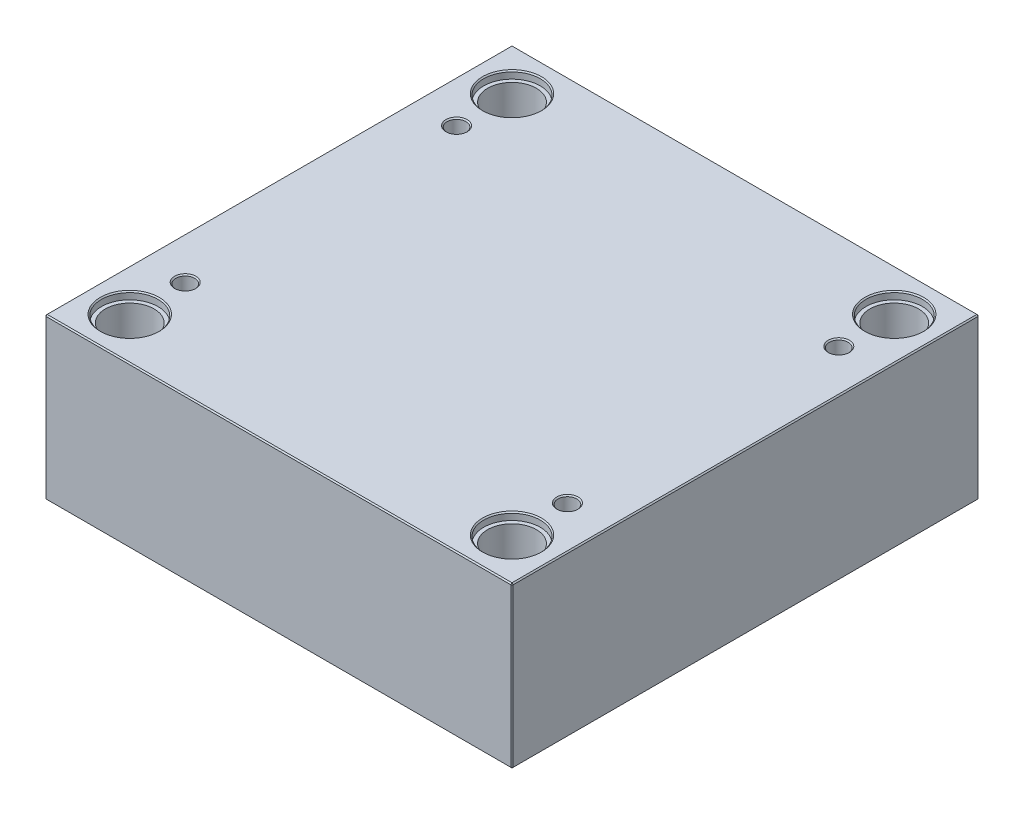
ISO-10303-21;
HEADER;
FILE_DESCRIPTION(('STEP AP214'),'2;1');
FILE_NAME('part.step','',(''),(''),'','','');
FILE_SCHEMA(('AUTOMOTIVE_DESIGN { 1 0 10303 214 1 1 1 1 }'));
ENDSEC;
DATA;
#1=APPLICATION_CONTEXT('core data for automotive mechanical design processes');
#2=APPLICATION_PROTOCOL_DEFINITION('international standard','automotive_design',2000,#1);
#3=PRODUCT_CONTEXT('',#1,'mechanical');
#4=PRODUCT('Part','Part','',(#3));
#5=PRODUCT_RELATED_PRODUCT_CATEGORY('part','',(#4));
#6=PRODUCT_DEFINITION_FORMATION('','',#4);
#7=PRODUCT_DEFINITION_CONTEXT('part definition',#1,'design');
#8=PRODUCT_DEFINITION('design','',#6,#7);
#9=PRODUCT_DEFINITION_SHAPE('','',#8);
#10=(LENGTH_UNIT() NAMED_UNIT(*) SI_UNIT(.MILLI.,.METRE.));
#11=(NAMED_UNIT(*) PLANE_ANGLE_UNIT() SI_UNIT($,.RADIAN.));
#12=(NAMED_UNIT(*) SI_UNIT($,.STERADIAN.) SOLID_ANGLE_UNIT());
#13=UNCERTAINTY_MEASURE_WITH_UNIT(LENGTH_MEASURE(1.E-05),#10,'distance_accuracy_value','');
#14=(GEOMETRIC_REPRESENTATION_CONTEXT(3) GLOBAL_UNCERTAINTY_ASSIGNED_CONTEXT((#13)) GLOBAL_UNIT_ASSIGNED_CONTEXT((#10,
#11,#12)) REPRESENTATION_CONTEXT('',''));
#15=CARTESIAN_POINT('',(0.,0.,0.));
#16=DIRECTION('',(0.,0.,1.));
#17=DIRECTION('',(1.,0.,0.));
#18=AXIS2_PLACEMENT_3D('',#15,#16,#17);
#19=CARTESIAN_POINT('',(-162.,0.,-162.));
#20=DIRECTION('',(0.,1.,0.));
#21=DIRECTION('',(0.,0.,1.));
#22=AXIS2_PLACEMENT_3D('',#19,#20,#21);
#23=CYLINDRICAL_SURFACE('',#22,20.65);
#24=CARTESIAN_POINT('',(-162.,0.999999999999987,-162.));
#25=DIRECTION('',(0.,1.,0.));
#26=DIRECTION('',(0.,0.,1.));
#27=AXIS2_PLACEMENT_3D('',#24,#25,#26);
#28=CIRCLE('',#27,20.65);
#29=CARTESIAN_POINT('',(-162.,0.999999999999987,-141.35));
#30=VERTEX_POINT('',#29);
#31=EDGE_CURVE('E471',#30,#30,#28,.F.);
#32=ORIENTED_EDGE('',*,*,#31,.T.);
#33=EDGE_LOOP('',(#32));
#34=FACE_BOUND('',#33,.T.);
#35=CARTESIAN_POINT('',(-162.,129.7,-162.));
#36=DIRECTION('',(0.,1.,0.));
#37=DIRECTION('',(0.,0.,1.));
#38=AXIS2_PLACEMENT_3D('',#35,#36,#37);
#39=CIRCLE('',#38,20.65);
#40=CARTESIAN_POINT('',(-162.,129.7,-141.35));
#41=VERTEX_POINT('',#40);
#42=EDGE_CURVE('E220',#41,#41,#39,.F.);
#43=ORIENTED_EDGE('',*,*,#42,.F.);
#44=EDGE_LOOP('',(#43));
#45=FACE_BOUND('',#44,.T.);
#46=ADVANCED_FACE('F15',(#34,#45),#23,.F.);
#47=CARTESIAN_POINT('',(162.,0.,-162.));
#48=DIRECTION('',(0.,1.,0.));
#49=DIRECTION('',(0.,0.,1.));
#50=AXIS2_PLACEMENT_3D('',#47,#48,#49);
#51=CYLINDRICAL_SURFACE('',#50,20.65);
#52=CARTESIAN_POINT('',(162.,0.999999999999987,-162.));
#53=DIRECTION('',(0.,1.,0.));
#54=DIRECTION('',(0.,0.,1.));
#55=AXIS2_PLACEMENT_3D('',#52,#53,#54);
#56=CIRCLE('',#55,20.65);
#57=CARTESIAN_POINT('',(162.,0.999999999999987,-141.35));
#58=VERTEX_POINT('',#57);
#59=EDGE_CURVE('E473',#58,#58,#56,.F.);
#60=ORIENTED_EDGE('',*,*,#59,.T.);
#61=EDGE_LOOP('',(#60));
#62=FACE_BOUND('',#61,.T.);
#63=CARTESIAN_POINT('',(162.,129.7,-162.));
#64=DIRECTION('',(0.,1.,0.));
#65=DIRECTION('',(0.,0.,1.));
#66=AXIS2_PLACEMENT_3D('',#63,#64,#65);
#67=CIRCLE('',#66,20.65);
#68=CARTESIAN_POINT('',(162.,129.7,-141.35));
#69=VERTEX_POINT('',#68);
#70=EDGE_CURVE('E217',#69,#69,#67,.F.);
#71=ORIENTED_EDGE('',*,*,#70,.F.);
#72=EDGE_LOOP('',(#71));
#73=FACE_BOUND('',#72,.T.);
#74=ADVANCED_FACE('F262',(#62,#73),#51,.F.);
#75=CARTESIAN_POINT('',(162.,0.,162.));
#76=DIRECTION('',(0.,1.,0.));
#77=DIRECTION('',(0.,0.,1.));
#78=AXIS2_PLACEMENT_3D('',#75,#76,#77);
#79=CYLINDRICAL_SURFACE('',#78,20.65);
#80=CARTESIAN_POINT('',(162.,0.999999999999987,162.));
#81=DIRECTION('',(0.,1.,0.));
#82=DIRECTION('',(0.,0.,1.));
#83=AXIS2_PLACEMENT_3D('',#80,#81,#82);
#84=CIRCLE('',#83,20.65);
#85=CARTESIAN_POINT('',(162.,0.999999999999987,182.65));
#86=VERTEX_POINT('',#85);
#87=EDGE_CURVE('E476',#86,#86,#84,.F.);
#88=ORIENTED_EDGE('',*,*,#87,.T.);
#89=EDGE_LOOP('',(#88));
#90=FACE_BOUND('',#89,.T.);
#91=CARTESIAN_POINT('',(162.,129.7,162.));
#92=DIRECTION('',(0.,1.,0.));
#93=DIRECTION('',(0.,0.,1.));
#94=AXIS2_PLACEMENT_3D('',#91,#92,#93);
#95=CIRCLE('',#94,20.65);
#96=CARTESIAN_POINT('',(162.,129.7,182.65));
#97=VERTEX_POINT('',#96);
#98=EDGE_CURVE('E213',#97,#97,#95,.F.);
#99=ORIENTED_EDGE('',*,*,#98,.F.);
#100=EDGE_LOOP('',(#99));
#101=FACE_BOUND('',#100,.T.);
#102=ADVANCED_FACE('F269',(#90,#101),#79,.F.);
#103=CARTESIAN_POINT('',(-162.,0.,162.));
#104=DIRECTION('',(0.,1.,0.));
#105=DIRECTION('',(0.,0.,1.));
#106=AXIS2_PLACEMENT_3D('',#103,#104,#105);
#107=CYLINDRICAL_SURFACE('',#106,20.65);
#108=CARTESIAN_POINT('',(-162.,0.999999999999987,162.));
#109=DIRECTION('',(0.,1.,0.));
#110=DIRECTION('',(0.,0.,1.));
#111=AXIS2_PLACEMENT_3D('',#108,#109,#110);
#112=CIRCLE('',#111,20.65);
#113=CARTESIAN_POINT('',(-162.,0.999999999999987,182.65));
#114=VERTEX_POINT('',#113);
#115=EDGE_CURVE('E479',#114,#114,#112,.F.);
#116=ORIENTED_EDGE('',*,*,#115,.T.);
#117=EDGE_LOOP('',(#116));
#118=FACE_BOUND('',#117,.T.);
#119=CARTESIAN_POINT('',(-162.,129.7,162.));
#120=DIRECTION('',(0.,1.,0.));
#121=DIRECTION('',(0.,0.,1.));
#122=AXIS2_PLACEMENT_3D('',#119,#120,#121);
#123=CIRCLE('',#122,20.65);
#124=CARTESIAN_POINT('',(-162.,129.7,182.65));
#125=VERTEX_POINT('',#124);
#126=EDGE_CURVE('E210',#125,#125,#123,.F.);
#127=ORIENTED_EDGE('',*,*,#126,.F.);
#128=EDGE_LOOP('',(#127));
#129=FACE_BOUND('',#128,.T.);
#130=ADVANCED_FACE('F276',(#118,#129),#107,.F.);
#131=CARTESIAN_POINT('',(-198.,136.,198.));
#132=DIRECTION('',(1.,0.,0.));
#133=DIRECTION('',(0.,0.,-1.));
#134=AXIS2_PLACEMENT_3D('',#131,#132,#133);
#135=PLANE('',#134);
#136=DIRECTION('',(0.,-1.,0.));
#137=VECTOR('',#136,1.);
#138=CARTESIAN_POINT('',(-198.,136.,-197.));
#139=LINE('',#138,#137);
#140=CARTESIAN_POINT('',(-198.,135.,-197.));
#141=VERTEX_POINT('',#140);
#142=CARTESIAN_POINT('',(-198.,1.,-197.));
#143=VERTEX_POINT('',#142);
#144=EDGE_CURVE('E486',#141,#143,#139,.T.);
#145=ORIENTED_EDGE('',*,*,#144,.T.);
#146=DIRECTION('',(0.,0.,1.));
#147=VECTOR('',#146,1.);
#148=CARTESIAN_POINT('',(-198.,1.,198.));
#149=LINE('',#148,#147);
#150=CARTESIAN_POINT('',(-198.,1.,197.));
#151=VERTEX_POINT('',#150);
#152=EDGE_CURVE('E489',#143,#151,#149,.T.);
#153=ORIENTED_EDGE('',*,*,#152,.T.);
#154=DIRECTION('',(0.,1.,0.));
#155=VECTOR('',#154,1.);
#156=CARTESIAN_POINT('',(-198.,136.,197.));
#157=LINE('',#156,#155);
#158=CARTESIAN_POINT('',(-198.,135.,197.));
#159=VERTEX_POINT('',#158);
#160=EDGE_CURVE('E484',#151,#159,#157,.T.);
#161=ORIENTED_EDGE('',*,*,#160,.T.);
#162=DIRECTION('',(0.,0.,-1.));
#163=VECTOR('',#162,1.);
#164=CARTESIAN_POINT('',(-198.,135.,-198.));
#165=LINE('',#164,#163);
#166=EDGE_CURVE('E482',#159,#141,#165,.T.);
#167=ORIENTED_EDGE('',*,*,#166,.T.);
#168=EDGE_LOOP('',(#145,#153,#161,#167));
#169=FACE_BOUND('',#168,.T.);
#170=ADVANCED_FACE('F297',(#169),#135,.F.);
#171=CARTESIAN_POINT('',(198.,136.,198.));
#172=DIRECTION('',(0.,0.,-1.));
#173=DIRECTION('',(-1.,0.,0.));
#174=AXIS2_PLACEMENT_3D('',#171,#172,#173);
#175=PLANE('',#174);
#176=DIRECTION('',(-1.,0.,0.));
#177=VECTOR('',#176,1.);
#178=CARTESIAN_POINT('',(-198.,135.,198.));
#179=LINE('',#178,#177);
#180=CARTESIAN_POINT('',(197.,135.,198.));
#181=VERTEX_POINT('',#180);
#182=CARTESIAN_POINT('',(-197.,135.,198.));
#183=VERTEX_POINT('',#182);
#184=EDGE_CURVE('E508',#181,#183,#179,.T.);
#185=ORIENTED_EDGE('',*,*,#184,.T.);
#186=DIRECTION('',(0.,-1.,0.));
#187=VECTOR('',#186,1.);
#188=CARTESIAN_POINT('',(-197.,136.,198.));
#189=LINE('',#188,#187);
#190=CARTESIAN_POINT('',(-197.,1.00000000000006,198.));
#191=VERTEX_POINT('',#190);
#192=EDGE_CURVE('E514',#183,#191,#189,.T.);
#193=ORIENTED_EDGE('',*,*,#192,.T.);
#194=DIRECTION('',(1.,0.,0.));
#195=VECTOR('',#194,1.);
#196=CARTESIAN_POINT('',(198.,1.00000000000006,198.));
#197=LINE('',#196,#195);
#198=CARTESIAN_POINT('',(197.,1.00000000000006,198.));
#199=VERTEX_POINT('',#198);
#200=EDGE_CURVE('E512',#191,#199,#197,.T.);
#201=ORIENTED_EDGE('',*,*,#200,.T.);
#202=DIRECTION('',(0.,1.,0.));
#203=VECTOR('',#202,1.);
#204=CARTESIAN_POINT('',(197.,136.,198.));
#205=LINE('',#204,#203);
#206=EDGE_CURVE('E510',#199,#181,#205,.T.);
#207=ORIENTED_EDGE('',*,*,#206,.T.);
#208=EDGE_LOOP('',(#185,#193,#201,#207));
#209=FACE_BOUND('',#208,.T.);
#210=ADVANCED_FACE('F293',(#209),#175,.F.);
#211=CARTESIAN_POINT('',(198.,136.,198.));
#212=DIRECTION('',(-1.,0.,0.));
#213=DIRECTION('',(0.,0.,1.));
#214=AXIS2_PLACEMENT_3D('',#211,#212,#213);
#215=PLANE('',#214);
#216=DIRECTION('',(0.,0.,-1.));
#217=VECTOR('',#216,1.);
#218=CARTESIAN_POINT('',(198.,1.00000000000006,198.));
#219=LINE('',#218,#217);
#220=CARTESIAN_POINT('',(198.,1.00000000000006,197.));
#221=VERTEX_POINT('',#220);
#222=CARTESIAN_POINT('',(198.,1.00000000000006,-197.));
#223=VERTEX_POINT('',#222);
#224=EDGE_CURVE('E503',#221,#223,#219,.T.);
#225=ORIENTED_EDGE('',*,*,#224,.T.);
#226=DIRECTION('',(0.,1.,0.));
#227=VECTOR('',#226,1.);
#228=CARTESIAN_POINT('',(198.,136.,-197.));
#229=LINE('',#228,#227);
#230=CARTESIAN_POINT('',(198.,135.,-197.));
#231=VERTEX_POINT('',#230);
#232=EDGE_CURVE('E505',#223,#231,#229,.T.);
#233=ORIENTED_EDGE('',*,*,#232,.T.);
#234=DIRECTION('',(0.,0.,1.));
#235=VECTOR('',#234,1.);
#236=CARTESIAN_POINT('',(198.,135.,198.));
#237=LINE('',#236,#235);
#238=CARTESIAN_POINT('',(198.,135.,197.));
#239=VERTEX_POINT('',#238);
#240=EDGE_CURVE('E499',#231,#239,#237,.T.);
#241=ORIENTED_EDGE('',*,*,#240,.T.);
#242=DIRECTION('',(0.,-1.,0.));
#243=VECTOR('',#242,1.);
#244=CARTESIAN_POINT('',(198.,136.,197.));
#245=LINE('',#244,#243);
#246=EDGE_CURVE('E501',#239,#221,#245,.T.);
#247=ORIENTED_EDGE('',*,*,#246,.T.);
#248=EDGE_LOOP('',(#225,#233,#241,#247));
#249=FACE_BOUND('',#248,.T.);
#250=ADVANCED_FACE('F289',(#249),#215,.F.);
#251=CARTESIAN_POINT('',(198.,136.,-198.));
#252=DIRECTION('',(0.,0.,1.));
#253=DIRECTION('',(1.,0.,0.));
#254=AXIS2_PLACEMENT_3D('',#251,#252,#253);
#255=PLANE('',#254);
#256=DIRECTION('',(0.,-1.,0.));
#257=VECTOR('',#256,1.);
#258=CARTESIAN_POINT('',(197.,136.,-198.));
#259=LINE('',#258,#257);
#260=CARTESIAN_POINT('',(197.,135.,-198.));
#261=VERTEX_POINT('',#260);
#262=CARTESIAN_POINT('',(197.,1.00000000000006,-198.));
#263=VERTEX_POINT('',#262);
#264=EDGE_CURVE('E493',#261,#263,#259,.T.);
#265=ORIENTED_EDGE('',*,*,#264,.T.);
#266=DIRECTION('',(-1.,0.,0.));
#267=VECTOR('',#266,1.);
#268=CARTESIAN_POINT('',(198.,1.00000000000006,-198.));
#269=LINE('',#268,#267);
#270=CARTESIAN_POINT('',(-197.,1.00000000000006,-198.));
#271=VERTEX_POINT('',#270);
#272=EDGE_CURVE('E137',#263,#271,#269,.T.);
#273=ORIENTED_EDGE('',*,*,#272,.T.);
#274=DIRECTION('',(0.,1.,0.));
#275=VECTOR('',#274,1.);
#276=CARTESIAN_POINT('',(-197.,136.,-198.));
#277=LINE('',#276,#275);
#278=CARTESIAN_POINT('',(-197.,135.,-198.));
#279=VERTEX_POINT('',#278);
#280=EDGE_CURVE('E495',#271,#279,#277,.T.);
#281=ORIENTED_EDGE('',*,*,#280,.T.);
#282=DIRECTION('',(1.,0.,0.));
#283=VECTOR('',#282,1.);
#284=CARTESIAN_POINT('',(198.,135.,-198.));
#285=LINE('',#284,#283);
#286=EDGE_CURVE('E491',#279,#261,#285,.T.);
#287=ORIENTED_EDGE('',*,*,#286,.T.);
#288=EDGE_LOOP('',(#265,#273,#281,#287));
#289=FACE_BOUND('',#288,.T.);
#290=ADVANCED_FACE('F281',(#289),#255,.F.);
#291=CARTESIAN_POINT('',(0.,136.,0.));
#292=DIRECTION('',(0.,1.,0.));
#293=DIRECTION('',(0.,0.,1.));
#294=AXIS2_PLACEMENT_3D('',#291,#292,#293);
#295=PLANE('',#294);
#296=CARTESIAN_POINT('',(162.,136.,162.));
#297=DIRECTION('',(0.,1.,0.));
#298=DIRECTION('',(0.,0.,1.));
#299=AXIS2_PLACEMENT_3D('',#296,#297,#298);
#300=CIRCLE('',#299,25.);
#301=CARTESIAN_POINT('',(162.,136.,187.));
#302=VERTEX_POINT('',#301);
#303=EDGE_CURVE('E235',#302,#302,#300,.F.);
#304=ORIENTED_EDGE('',*,*,#303,.T.);
#305=EDGE_LOOP('',(#304));
#306=FACE_BOUND('',#305,.T.);
#307=CARTESIAN_POINT('',(-162.,136.,162.));
#308=DIRECTION('',(0.,1.,0.));
#309=DIRECTION('',(0.,0.,1.));
#310=AXIS2_PLACEMENT_3D('',#307,#308,#309);
#311=CIRCLE('',#310,25.);
#312=CARTESIAN_POINT('',(-162.,136.,187.));
#313=VERTEX_POINT('',#312);
#314=EDGE_CURVE('E232',#313,#313,#311,.F.);
#315=ORIENTED_EDGE('',*,*,#314,.T.);
#316=EDGE_LOOP('',(#315));
#317=FACE_BOUND('',#316,.T.);
#318=CARTESIAN_POINT('',(162.,136.,-162.));
#319=DIRECTION('',(0.,1.,0.));
#320=DIRECTION('',(0.,0.,1.));
#321=AXIS2_PLACEMENT_3D('',#318,#319,#320);
#322=CIRCLE('',#321,25.);
#323=CARTESIAN_POINT('',(162.,136.,-137.));
#324=VERTEX_POINT('',#323);
#325=EDGE_CURVE('E229',#324,#324,#322,.F.);
#326=ORIENTED_EDGE('',*,*,#325,.T.);
#327=EDGE_LOOP('',(#326));
#328=FACE_BOUND('',#327,.T.);
#329=CARTESIAN_POINT('',(-162.,136.,-162.));
#330=DIRECTION('',(0.,1.,0.));
#331=DIRECTION('',(0.,0.,1.));
#332=AXIS2_PLACEMENT_3D('',#329,#330,#331);
#333=CIRCLE('',#332,25.);
#334=CARTESIAN_POINT('',(-162.,136.,-137.));
#335=VERTEX_POINT('',#334);
#336=EDGE_CURVE('E226',#335,#335,#333,.F.);
#337=ORIENTED_EDGE('',*,*,#336,.T.);
#338=EDGE_LOOP('',(#337));
#339=FACE_BOUND('',#338,.T.);
#340=CARTESIAN_POINT('',(-162.,136.,115.));
#341=DIRECTION('',(0.,1.,0.));
#342=DIRECTION('',(0.,0.,1.));
#343=AXIS2_PLACEMENT_3D('',#340,#341,#342);
#344=CIRCLE('',#343,9.);
#345=CARTESIAN_POINT('',(-162.,136.,124.));
#346=VERTEX_POINT('',#345);
#347=EDGE_CURVE('E197',#346,#346,#344,.F.);
#348=ORIENTED_EDGE('',*,*,#347,.T.);
#349=EDGE_LOOP('',(#348));
#350=FACE_BOUND('',#349,.T.);
#351=CARTESIAN_POINT('',(162.,136.,115.));
#352=DIRECTION('',(0.,1.,0.));
#353=DIRECTION('',(0.,0.,1.));
#354=AXIS2_PLACEMENT_3D('',#351,#352,#353);
#355=CIRCLE('',#354,9.);
#356=CARTESIAN_POINT('',(162.,136.,124.));
#357=VERTEX_POINT('',#356);
#358=EDGE_CURVE('E194',#357,#357,#355,.F.);
#359=ORIENTED_EDGE('',*,*,#358,.T.);
#360=EDGE_LOOP('',(#359));
#361=FACE_BOUND('',#360,.T.);
#362=CARTESIAN_POINT('',(162.,136.,-115.));
#363=DIRECTION('',(0.,1.,0.));
#364=DIRECTION('',(0.,0.,1.));
#365=AXIS2_PLACEMENT_3D('',#362,#363,#364);
#366=CIRCLE('',#365,9.);
#367=CARTESIAN_POINT('',(162.,136.,-106.));
#368=VERTEX_POINT('',#367);
#369=EDGE_CURVE('E191',#368,#368,#366,.F.);
#370=ORIENTED_EDGE('',*,*,#369,.T.);
#371=EDGE_LOOP('',(#370));
#372=FACE_BOUND('',#371,.T.);
#373=CARTESIAN_POINT('',(-162.,136.,-115.));
#374=DIRECTION('',(0.,1.,0.));
#375=DIRECTION('',(0.,0.,1.));
#376=AXIS2_PLACEMENT_3D('',#373,#374,#375);
#377=CIRCLE('',#376,9.);
#378=CARTESIAN_POINT('',(-162.,136.,-106.));
#379=VERTEX_POINT('',#378);
#380=EDGE_CURVE('E187',#379,#379,#377,.F.);
#381=ORIENTED_EDGE('',*,*,#380,.T.);
#382=EDGE_LOOP('',(#381));
#383=FACE_BOUND('',#382,.T.);
#384=DIRECTION('',(0.,0.,-1.));
#385=VECTOR('',#384,1.);
#386=CARTESIAN_POINT('',(197.,136.,-198.));
#387=LINE('',#386,#385);
#388=CARTESIAN_POINT('',(197.,136.,197.));
#389=VERTEX_POINT('',#388);
#390=CARTESIAN_POINT('',(197.,136.,-197.));
#391=VERTEX_POINT('',#390);
#392=EDGE_CURVE('E30',#389,#391,#387,.T.);
#393=ORIENTED_EDGE('',*,*,#392,.T.);
#394=DIRECTION('',(-1.,0.,0.));
#395=VECTOR('',#394,1.);
#396=CARTESIAN_POINT('',(-198.,136.,-197.));
#397=LINE('',#396,#395);
#398=CARTESIAN_POINT('',(-197.,136.,-197.));
#399=VERTEX_POINT('',#398);
#400=EDGE_CURVE('E188',#391,#399,#397,.T.);
#401=ORIENTED_EDGE('',*,*,#400,.T.);
#402=DIRECTION('',(0.,0.,1.));
#403=VECTOR('',#402,1.);
#404=CARTESIAN_POINT('',(-197.,136.,198.));
#405=LINE('',#404,#403);
#406=CARTESIAN_POINT('',(-197.,136.,197.));
#407=VERTEX_POINT('',#406);
#408=EDGE_CURVE('E517',#399,#407,#405,.T.);
#409=ORIENTED_EDGE('',*,*,#408,.T.);
#410=DIRECTION('',(1.,0.,0.));
#411=VECTOR('',#410,1.);
#412=CARTESIAN_POINT('',(198.,136.,197.));
#413=LINE('',#412,#411);
#414=EDGE_CURVE('E35',#407,#389,#413,.T.);
#415=ORIENTED_EDGE('',*,*,#414,.T.);
#416=EDGE_LOOP('',(#393,#401,#409,#415));
#417=FACE_BOUND('',#416,.T.);
#418=ADVANCED_FACE('F278',(#306,#317,#328,#339,#350,#361,#372,#383,#417),#295,.T.);
#419=CARTESIAN_POINT('',(0.,0.,0.));
#420=DIRECTION('',(0.,1.,0.));
#421=DIRECTION('',(0.,0.,1.));
#422=AXIS2_PLACEMENT_3D('',#419,#420,#421);
#423=PLANE('',#422);
#424=CARTESIAN_POINT('',(-162.,0.,-162.));
#425=DIRECTION('',(0.,1.,0.));
#426=DIRECTION('',(0.,0.,1.));
#427=AXIS2_PLACEMENT_3D('',#424,#425,#426);
#428=CIRCLE('',#427,21.65);
#429=CARTESIAN_POINT('',(-162.,0.,-140.35));
#430=VERTEX_POINT('',#429);
#431=EDGE_CURVE('E468',#430,#430,#428,.T.);
#432=ORIENTED_EDGE('',*,*,#431,.T.);
#433=EDGE_LOOP('',(#432));
#434=FACE_BOUND('',#433,.T.);
#435=CARTESIAN_POINT('',(162.,0.,-162.));
#436=DIRECTION('',(0.,1.,0.));
#437=DIRECTION('',(0.,0.,1.));
#438=AXIS2_PLACEMENT_3D('',#435,#436,#437);
#439=CIRCLE('',#438,21.65);
#440=CARTESIAN_POINT('',(162.,0.,-140.35));
#441=VERTEX_POINT('',#440);
#442=EDGE_CURVE('E465',#441,#441,#439,.T.);
#443=ORIENTED_EDGE('',*,*,#442,.T.);
#444=EDGE_LOOP('',(#443));
#445=FACE_BOUND('',#444,.T.);
#446=CARTESIAN_POINT('',(162.,0.,162.));
#447=DIRECTION('',(0.,1.,0.));
#448=DIRECTION('',(0.,0.,1.));
#449=AXIS2_PLACEMENT_3D('',#446,#447,#448);
#450=CIRCLE('',#449,21.65);
#451=CARTESIAN_POINT('',(162.,0.,183.65));
#452=VERTEX_POINT('',#451);
#453=EDGE_CURVE('E462',#452,#452,#450,.T.);
#454=ORIENTED_EDGE('',*,*,#453,.T.);
#455=EDGE_LOOP('',(#454));
#456=FACE_BOUND('',#455,.T.);
#457=CARTESIAN_POINT('',(-162.,0.,162.));
#458=DIRECTION('',(0.,1.,0.));
#459=DIRECTION('',(0.,0.,1.));
#460=AXIS2_PLACEMENT_3D('',#457,#458,#459);
#461=CIRCLE('',#460,21.65);
#462=CARTESIAN_POINT('',(-162.,0.,183.65));
#463=VERTEX_POINT('',#462);
#464=EDGE_CURVE('E459',#463,#463,#461,.T.);
#465=ORIENTED_EDGE('',*,*,#464,.T.);
#466=EDGE_LOOP('',(#465));
#467=FACE_BOUND('',#466,.T.);
#468=DIRECTION('',(0.,0.,1.));
#469=VECTOR('',#468,1.);
#470=CARTESIAN_POINT('',(197.,0.,0.));
#471=LINE('',#470,#469);
#472=CARTESIAN_POINT('',(197.,0.,-197.));
#473=VERTEX_POINT('',#472);
#474=CARTESIAN_POINT('',(197.,0.,197.));
#475=VERTEX_POINT('',#474);
#476=EDGE_CURVE('E107',#473,#475,#471,.T.);
#477=ORIENTED_EDGE('',*,*,#476,.T.);
#478=DIRECTION('',(-1.,0.,0.));
#479=VECTOR('',#478,1.);
#480=CARTESIAN_POINT('',(0.,0.,197.));
#481=LINE('',#480,#479);
#482=CARTESIAN_POINT('',(-197.,0.,197.));
#483=VERTEX_POINT('',#482);
#484=EDGE_CURVE('E457',#475,#483,#481,.T.);
#485=ORIENTED_EDGE('',*,*,#484,.T.);
#486=DIRECTION('',(0.,0.,-1.));
#487=VECTOR('',#486,1.);
#488=CARTESIAN_POINT('',(-197.,0.,0.));
#489=LINE('',#488,#487);
#490=CARTESIAN_POINT('',(-197.,0.,-197.));
#491=VERTEX_POINT('',#490);
#492=EDGE_CURVE('E109',#483,#491,#489,.T.);
#493=ORIENTED_EDGE('',*,*,#492,.T.);
#494=DIRECTION('',(1.,0.,0.));
#495=VECTOR('',#494,1.);
#496=CARTESIAN_POINT('',(0.,0.,-197.));
#497=LINE('',#496,#495);
#498=EDGE_CURVE('E103',#491,#473,#497,.T.);
#499=ORIENTED_EDGE('',*,*,#498,.T.);
#500=EDGE_LOOP('',(#477,#485,#493,#499));
#501=FACE_BOUND('',#500,.T.);
#502=ADVANCED_FACE('F105',(#434,#445,#456,#467,#501),#423,.F.);
#503=CARTESIAN_POINT('',(-162.,0.,-162.));
#504=DIRECTION('',(0.,-1.,0.));
#505=DIRECTION('',(0.,0.,-1.));
#506=AXIS2_PLACEMENT_3D('',#503,#504,#505);
#507=CONICAL_SURFACE('',#506,21.65,0.785398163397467);
#508=ORIENTED_EDGE('',*,*,#31,.F.);
#509=EDGE_LOOP('',(#508));
#510=FACE_BOUND('',#509,.T.);
#511=ORIENTED_EDGE('',*,*,#431,.F.);
#512=EDGE_LOOP('',(#511));
#513=FACE_BOUND('',#512,.T.);
#514=ADVANCED_FACE('F285',(#510,#513),#507,.F.);
#515=CARTESIAN_POINT('',(162.,0.,-162.));
#516=DIRECTION('',(0.,-1.,0.));
#517=DIRECTION('',(0.,0.,-1.));
#518=AXIS2_PLACEMENT_3D('',#515,#516,#517);
#519=CONICAL_SURFACE('',#518,21.65,0.785398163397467);
#520=ORIENTED_EDGE('',*,*,#59,.F.);
#521=EDGE_LOOP('',(#520));
#522=FACE_BOUND('',#521,.T.);
#523=ORIENTED_EDGE('',*,*,#442,.F.);
#524=EDGE_LOOP('',(#523));
#525=FACE_BOUND('',#524,.T.);
#526=ADVANCED_FACE('F304',(#522,#525),#519,.F.);
#527=CARTESIAN_POINT('',(162.,0.,162.));
#528=DIRECTION('',(0.,-1.,0.));
#529=DIRECTION('',(0.,0.,-1.));
#530=AXIS2_PLACEMENT_3D('',#527,#528,#529);
#531=CONICAL_SURFACE('',#530,21.65,0.785398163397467);
#532=ORIENTED_EDGE('',*,*,#87,.F.);
#533=EDGE_LOOP('',(#532));
#534=FACE_BOUND('',#533,.T.);
#535=ORIENTED_EDGE('',*,*,#453,.F.);
#536=EDGE_LOOP('',(#535));
#537=FACE_BOUND('',#536,.T.);
#538=ADVANCED_FACE('F308',(#534,#537),#531,.F.);
#539=CARTESIAN_POINT('',(-162.,0.,162.));
#540=DIRECTION('',(0.,-1.,0.));
#541=DIRECTION('',(0.,0.,-1.));
#542=AXIS2_PLACEMENT_3D('',#539,#540,#541);
#543=CONICAL_SURFACE('',#542,21.65,0.785398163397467);
#544=ORIENTED_EDGE('',*,*,#115,.F.);
#545=EDGE_LOOP('',(#544));
#546=FACE_BOUND('',#545,.T.);
#547=ORIENTED_EDGE('',*,*,#464,.F.);
#548=EDGE_LOOP('',(#547));
#549=FACE_BOUND('',#548,.T.);
#550=ADVANCED_FACE('F312',(#546,#549),#543,.F.);
#551=CARTESIAN_POINT('',(198.,136.,197.));
#552=DIRECTION('',(-0.707106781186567,0.,-0.707106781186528));
#553=DIRECTION('',(0.,-1.,0.));
#554=AXIS2_PLACEMENT_3D('',#551,#552,#553);
#555=PLANE('',#554);
#556=DIRECTION('',(-0.707106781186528,0.,0.707106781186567));
#557=VECTOR('',#556,1.);
#558=CARTESIAN_POINT('',(197.,135.,198.));
#559=LINE('',#558,#557);
#560=EDGE_CURVE('E125',#181,#239,#559,.F.);
#561=ORIENTED_EDGE('',*,*,#560,.F.);
#562=ORIENTED_EDGE('',*,*,#206,.F.);
#563=DIRECTION('',(0.707106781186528,0.,-0.707106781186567));
#564=VECTOR('',#563,1.);
#565=CARTESIAN_POINT('',(197.,1.00000000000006,198.));
#566=LINE('',#565,#564);
#567=EDGE_CURVE('E179',#221,#199,#566,.F.);
#568=ORIENTED_EDGE('',*,*,#567,.F.);
#569=ORIENTED_EDGE('',*,*,#246,.F.);
#570=EDGE_LOOP('',(#561,#562,#568,#569));
#571=FACE_BOUND('',#570,.T.);
#572=ADVANCED_FACE('F316',(#571),#555,.F.);
#573=CARTESIAN_POINT('',(197.,135.,198.));
#574=DIRECTION('',(0.577350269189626,0.577350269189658,0.577350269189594));
#575=DIRECTION('',(-0.707106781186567,0.707106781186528,0.));
#576=AXIS2_PLACEMENT_3D('',#573,#574,#575);
#577=PLANE('',#576);
#578=DIRECTION('',(0.,-0.707106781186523,0.707106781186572));
#579=VECTOR('',#578,1.);
#580=CARTESIAN_POINT('',(197.,135.,198.));
#581=LINE('',#580,#579);
#582=EDGE_CURVE('E174',#181,#389,#581,.F.);
#583=ORIENTED_EDGE('',*,*,#582,.F.);
#584=ORIENTED_EDGE('',*,*,#560,.T.);
#585=DIRECTION('',(-0.707106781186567,0.707106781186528,0.));
#586=VECTOR('',#585,1.);
#587=CARTESIAN_POINT('',(197.5,135.5,197.));
#588=LINE('',#587,#586);
#589=EDGE_CURVE('E176',#389,#239,#588,.F.);
#590=ORIENTED_EDGE('',*,*,#589,.F.);
#591=EDGE_LOOP('',(#583,#584,#590));
#592=FACE_BOUND('',#591,.T.);
#593=ADVANCED_FACE('F384',(#592),#577,.T.);
#594=CARTESIAN_POINT('',(197.,1.00000000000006,198.));
#595=DIRECTION('',(0.577350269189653,-0.577350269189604,0.57735026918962));
#596=DIRECTION('',(0.707106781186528,0.,-0.707106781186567));
#597=AXIS2_PLACEMENT_3D('',#594,#595,#596);
#598=PLANE('',#597);
#599=DIRECTION('',(-0.707106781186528,-0.707106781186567,0.));
#600=VECTOR('',#599,1.);
#601=CARTESIAN_POINT('',(197.5,0.500000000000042,197.));
#602=LINE('',#601,#600);
#603=EDGE_CURVE('E123',#221,#475,#602,.T.);
#604=ORIENTED_EDGE('',*,*,#603,.F.);
#605=ORIENTED_EDGE('',*,*,#567,.T.);
#606=DIRECTION('',(0.,0.707106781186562,0.707106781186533));
#607=VECTOR('',#606,1.);
#608=CARTESIAN_POINT('',(197.,1.00000000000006,198.));
#609=LINE('',#608,#607);
#610=EDGE_CURVE('E171',#475,#199,#609,.T.);
#611=ORIENTED_EDGE('',*,*,#610,.F.);
#612=EDGE_LOOP('',(#604,#605,#611));
#613=FACE_BOUND('',#612,.T.);
#614=ADVANCED_FACE('F380',(#613),#598,.T.);
#615=CARTESIAN_POINT('',(197.,136.,0.));
#616=DIRECTION('',(0.707106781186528,0.707106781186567,0.));
#617=DIRECTION('',(0.,0.,1.));
#618=AXIS2_PLACEMENT_3D('',#615,#616,#617);
#619=PLANE('',#618);
#620=ORIENTED_EDGE('',*,*,#589,.T.);
#621=ORIENTED_EDGE('',*,*,#240,.F.);
#622=DIRECTION('',(0.707106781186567,-0.707106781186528,0.));
#623=VECTOR('',#622,1.);
#624=CARTESIAN_POINT('',(198.,135.,-197.));
#625=LINE('',#624,#623);
#626=EDGE_CURVE('E165',#391,#231,#625,.T.);
#627=ORIENTED_EDGE('',*,*,#626,.F.);
#628=ORIENTED_EDGE('',*,*,#392,.F.);
#629=EDGE_LOOP('',(#620,#621,#627,#628));
#630=FACE_BOUND('',#629,.T.);
#631=ADVANCED_FACE('F376',(#630),#619,.T.);
#632=CARTESIAN_POINT('',(0.,136.,197.));
#633=DIRECTION('',(0.,0.707106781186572,0.707106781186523));
#634=DIRECTION('',(-1.,0.,0.));
#635=AXIS2_PLACEMENT_3D('',#632,#633,#634);
#636=PLANE('',#635);
#637=ORIENTED_EDGE('',*,*,#582,.T.);
#638=ORIENTED_EDGE('',*,*,#414,.F.);
#639=DIRECTION('',(0.,0.707106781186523,-0.707106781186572));
#640=VECTOR('',#639,1.);
#641=CARTESIAN_POINT('',(-197.,135.5,197.5));
#642=LINE('',#641,#640);
#643=EDGE_CURVE('E162',#183,#407,#642,.T.);
#644=ORIENTED_EDGE('',*,*,#643,.F.);
#645=ORIENTED_EDGE('',*,*,#184,.F.);
#646=EDGE_LOOP('',(#637,#638,#644,#645));
#647=FACE_BOUND('',#646,.T.);
#648=ADVANCED_FACE('F372',(#647),#636,.T.);
#649=CARTESIAN_POINT('',(-197.,136.,198.));
#650=DIRECTION('',(0.707106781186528,0.,-0.707106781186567));
#651=DIRECTION('',(0.,-1.,0.));
#652=AXIS2_PLACEMENT_3D('',#649,#650,#651);
#653=PLANE('',#652);
#654=DIRECTION('',(0.707106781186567,0.,0.707106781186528));
#655=VECTOR('',#654,1.);
#656=CARTESIAN_POINT('',(-197.,1.00000000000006,198.));
#657=LINE('',#656,#655);
#658=EDGE_CURVE('E156',#191,#151,#657,.F.);
#659=ORIENTED_EDGE('',*,*,#658,.F.);
#660=ORIENTED_EDGE('',*,*,#192,.F.);
#661=DIRECTION('',(-0.707106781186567,0.,-0.707106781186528));
#662=VECTOR('',#661,1.);
#663=CARTESIAN_POINT('',(-198.,135.,197.));
#664=LINE('',#663,#662);
#665=EDGE_CURVE('E159',#159,#183,#664,.F.);
#666=ORIENTED_EDGE('',*,*,#665,.F.);
#667=ORIENTED_EDGE('',*,*,#160,.F.);
#668=EDGE_LOOP('',(#659,#660,#666,#667));
#669=FACE_BOUND('',#668,.T.);
#670=ADVANCED_FACE('F368',(#669),#653,.F.);
#671=CARTESIAN_POINT('',(198.,1.00000000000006,198.));
#672=DIRECTION('',(0.,0.707106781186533,-0.707106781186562));
#673=DIRECTION('',(1.,0.,0.));
#674=AXIS2_PLACEMENT_3D('',#671,#672,#673);
#675=PLANE('',#674);
#676=ORIENTED_EDGE('',*,*,#610,.T.);
#677=ORIENTED_EDGE('',*,*,#200,.F.);
#678=DIRECTION('',(0.,-0.707106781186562,-0.707106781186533));
#679=VECTOR('',#678,1.);
#680=CARTESIAN_POINT('',(-197.,1.00000000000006,198.));
#681=LINE('',#680,#679);
#682=EDGE_CURVE('E134',#483,#191,#681,.F.);
#683=ORIENTED_EDGE('',*,*,#682,.F.);
#684=ORIENTED_EDGE('',*,*,#484,.F.);
#685=EDGE_LOOP('',(#676,#677,#683,#684));
#686=FACE_BOUND('',#685,.T.);
#687=ADVANCED_FACE('F365',(#686),#675,.F.);
#688=CARTESIAN_POINT('',(198.,1.00000000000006,198.));
#689=DIRECTION('',(-0.707106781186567,0.707106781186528,0.));
#690=DIRECTION('',(0.,0.,-1.));
#691=AXIS2_PLACEMENT_3D('',#688,#689,#690);
#692=PLANE('',#691);
#693=ORIENTED_EDGE('',*,*,#603,.T.);
#694=ORIENTED_EDGE('',*,*,#476,.F.);
#695=DIRECTION('',(0.707106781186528,0.707106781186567,0.));
#696=VECTOR('',#695,1.);
#697=CARTESIAN_POINT('',(197.5,0.500000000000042,-197.));
#698=LINE('',#697,#696);
#699=EDGE_CURVE('E120',#223,#473,#698,.F.);
#700=ORIENTED_EDGE('',*,*,#699,.F.);
#701=ORIENTED_EDGE('',*,*,#224,.F.);
#702=EDGE_LOOP('',(#693,#694,#700,#701));
#703=FACE_BOUND('',#702,.T.);
#704=ADVANCED_FACE('F118',(#703),#692,.F.);
#705=CARTESIAN_POINT('',(197.,136.,-198.));
#706=DIRECTION('',(-0.707106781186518,0.,0.707106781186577));
#707=DIRECTION('',(0.,-1.,0.));
#708=AXIS2_PLACEMENT_3D('',#705,#706,#707);
#709=PLANE('',#708);
#710=DIRECTION('',(0.707106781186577,0.,0.707106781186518));
#711=VECTOR('',#710,1.);
#712=CARTESIAN_POINT('',(198.,135.,-197.));
#713=LINE('',#712,#711);
#714=EDGE_CURVE('E167',#231,#261,#713,.F.);
#715=ORIENTED_EDGE('',*,*,#714,.F.);
#716=ORIENTED_EDGE('',*,*,#232,.F.);
#717=DIRECTION('',(-0.707106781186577,0.,-0.707106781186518));
#718=VECTOR('',#717,1.);
#719=CARTESIAN_POINT('',(197.,1.00000000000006,-198.));
#720=LINE('',#719,#718);
#721=EDGE_CURVE('E133',#263,#223,#720,.F.);
#722=ORIENTED_EDGE('',*,*,#721,.F.);
#723=ORIENTED_EDGE('',*,*,#264,.F.);
#724=EDGE_LOOP('',(#715,#716,#722,#723));
#725=FACE_BOUND('',#724,.T.);
#726=ADVANCED_FACE('F358',(#725),#709,.F.);
#727=CARTESIAN_POINT('',(198.,135.,-197.));
#728=DIRECTION('',(0.577350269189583,0.577350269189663,-0.577350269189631));
#729=DIRECTION('',(0.,0.707106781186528,0.707106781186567));
#730=AXIS2_PLACEMENT_3D('',#727,#728,#729);
#731=PLANE('',#730);
#732=ORIENTED_EDGE('',*,*,#626,.T.);
#733=ORIENTED_EDGE('',*,*,#714,.T.);
#734=DIRECTION('',(0.,0.707106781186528,0.707106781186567));
#735=VECTOR('',#734,1.);
#736=CARTESIAN_POINT('',(197.,135.5,-197.5));
#737=LINE('',#736,#735);
#738=EDGE_CURVE('E151',#391,#261,#737,.F.);
#739=ORIENTED_EDGE('',*,*,#738,.F.);
#740=EDGE_LOOP('',(#732,#733,#739));
#741=FACE_BOUND('',#740,.T.);
#742=ADVANCED_FACE('F354',(#741),#731,.T.);
#743=CARTESIAN_POINT('',(-198.,135.,197.));
#744=DIRECTION('',(-0.577350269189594,0.577350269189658,0.577350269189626));
#745=DIRECTION('',(0.,-0.707106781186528,0.707106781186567));
#746=AXIS2_PLACEMENT_3D('',#743,#744,#745);
#747=PLANE('',#746);
#748=ORIENTED_EDGE('',*,*,#665,.T.);
#749=ORIENTED_EDGE('',*,*,#643,.T.);
#750=DIRECTION('',(-0.707106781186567,-0.707106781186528,0.));
#751=VECTOR('',#750,1.);
#752=CARTESIAN_POINT('',(-198.,135.,197.));
#753=LINE('',#752,#751);
#754=EDGE_CURVE('E142',#159,#407,#753,.F.);
#755=ORIENTED_EDGE('',*,*,#754,.F.);
#756=EDGE_LOOP('',(#748,#749,#755));
#757=FACE_BOUND('',#756,.T.);
#758=ADVANCED_FACE('F350',(#757),#747,.T.);
#759=CARTESIAN_POINT('',(-197.,1.00000000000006,198.));
#760=DIRECTION('',(-0.577350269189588,-0.577350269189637,0.577350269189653));
#761=DIRECTION('',(0.,-0.707106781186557,-0.707106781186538));
#762=AXIS2_PLACEMENT_3D('',#759,#760,#761);
#763=PLANE('',#762);
#764=ORIENTED_EDGE('',*,*,#682,.T.);
#765=ORIENTED_EDGE('',*,*,#658,.T.);
#766=DIRECTION('',(-0.707106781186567,0.707106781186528,0.));
#767=VECTOR('',#766,1.);
#768=CARTESIAN_POINT('',(-197.5,0.500000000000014,197.));
#769=LINE('',#768,#767);
#770=EDGE_CURVE('E138',#483,#151,#769,.T.);
#771=ORIENTED_EDGE('',*,*,#770,.F.);
#772=EDGE_LOOP('',(#764,#765,#771));
#773=FACE_BOUND('',#772,.T.);
#774=ADVANCED_FACE('F347',(#773),#763,.T.);
#775=CARTESIAN_POINT('',(197.,1.00000000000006,-198.));
#776=DIRECTION('',(0.577350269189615,-0.577350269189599,-0.577350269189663));
#777=DIRECTION('',(-0.707106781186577,0.,-0.707106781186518));
#778=AXIS2_PLACEMENT_3D('',#775,#776,#777);
#779=PLANE('',#778);
#780=ORIENTED_EDGE('',*,*,#721,.T.);
#781=ORIENTED_EDGE('',*,*,#699,.T.);
#782=DIRECTION('',(0.,-0.707106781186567,0.707106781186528));
#783=VECTOR('',#782,1.);
#784=CARTESIAN_POINT('',(197.,1.00000000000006,-198.));
#785=LINE('',#784,#783);
#786=EDGE_CURVE('E130',#263,#473,#785,.T.);
#787=ORIENTED_EDGE('',*,*,#786,.F.);
#788=EDGE_LOOP('',(#780,#781,#787));
#789=FACE_BOUND('',#788,.T.);
#790=ADVANCED_FACE('F129',(#789),#779,.T.);
#791=CARTESIAN_POINT('',(0.,136.,-197.));
#792=DIRECTION('',(0.,0.707106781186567,-0.707106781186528));
#793=DIRECTION('',(1.,0.,0.));
#794=AXIS2_PLACEMENT_3D('',#791,#792,#793);
#795=PLANE('',#794);
#796=ORIENTED_EDGE('',*,*,#738,.T.);
#797=ORIENTED_EDGE('',*,*,#286,.F.);
#798=DIRECTION('',(0.,-0.707106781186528,-0.707106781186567));
#799=VECTOR('',#798,1.);
#800=CARTESIAN_POINT('',(-197.,135.,-198.));
#801=LINE('',#800,#799);
#802=EDGE_CURVE('E139',#399,#279,#801,.T.);
#803=ORIENTED_EDGE('',*,*,#802,.F.);
#804=ORIENTED_EDGE('',*,*,#400,.F.);
#805=EDGE_LOOP('',(#796,#797,#803,#804));
#806=FACE_BOUND('',#805,.T.);
#807=ADVANCED_FACE('F340',(#806),#795,.T.);
#808=CARTESIAN_POINT('',(-197.,136.,0.));
#809=DIRECTION('',(-0.707106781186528,0.707106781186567,0.));
#810=DIRECTION('',(0.,0.,-1.));
#811=AXIS2_PLACEMENT_3D('',#808,#809,#810);
#812=PLANE('',#811);
#813=ORIENTED_EDGE('',*,*,#754,.T.);
#814=ORIENTED_EDGE('',*,*,#408,.F.);
#815=DIRECTION('',(0.707106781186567,0.707106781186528,0.));
#816=VECTOR('',#815,1.);
#817=CARTESIAN_POINT('',(-197.5,135.5,-197.));
#818=LINE('',#817,#816);
#819=EDGE_CURVE('E145',#141,#399,#818,.T.);
#820=ORIENTED_EDGE('',*,*,#819,.F.);
#821=ORIENTED_EDGE('',*,*,#166,.F.);
#822=EDGE_LOOP('',(#813,#814,#820,#821));
#823=FACE_BOUND('',#822,.T.);
#824=ADVANCED_FACE('F336',(#823),#812,.T.);
#825=CARTESIAN_POINT('',(-198.,1.,198.));
#826=DIRECTION('',(0.707106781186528,0.707106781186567,0.));
#827=DIRECTION('',(0.,0.,1.));
#828=AXIS2_PLACEMENT_3D('',#825,#826,#827);
#829=PLANE('',#828);
#830=ORIENTED_EDGE('',*,*,#770,.T.);
#831=ORIENTED_EDGE('',*,*,#152,.F.);
#832=DIRECTION('',(0.707106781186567,-0.707106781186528,0.));
#833=VECTOR('',#832,1.);
#834=CARTESIAN_POINT('',(-198.,1.,-197.));
#835=LINE('',#834,#833);
#836=EDGE_CURVE('E528',#491,#143,#835,.F.);
#837=ORIENTED_EDGE('',*,*,#836,.F.);
#838=ORIENTED_EDGE('',*,*,#492,.F.);
#839=EDGE_LOOP('',(#830,#831,#837,#838));
#840=FACE_BOUND('',#839,.T.);
#841=ADVANCED_FACE('F333',(#840),#829,.F.);
#842=CARTESIAN_POINT('',(198.,1.00000000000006,-198.));
#843=DIRECTION('',(0.,0.707106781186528,0.707106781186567));
#844=DIRECTION('',(-1.,0.,0.));
#845=AXIS2_PLACEMENT_3D('',#842,#843,#844);
#846=PLANE('',#845);
#847=ORIENTED_EDGE('',*,*,#786,.T.);
#848=ORIENTED_EDGE('',*,*,#498,.F.);
#849=DIRECTION('',(0.,0.707106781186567,-0.707106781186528));
#850=VECTOR('',#849,1.);
#851=CARTESIAN_POINT('',(-197.,0.500000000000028,-197.5));
#852=LINE('',#851,#850);
#853=EDGE_CURVE('E525',#271,#491,#852,.F.);
#854=ORIENTED_EDGE('',*,*,#853,.F.);
#855=ORIENTED_EDGE('',*,*,#272,.F.);
#856=EDGE_LOOP('',(#847,#848,#854,#855));
#857=FACE_BOUND('',#856,.T.);
#858=ADVANCED_FACE('F136',(#857),#846,.F.);
#859=CARTESIAN_POINT('',(-197.,135.,-198.));
#860=DIRECTION('',(-0.577350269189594,0.577350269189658,-0.577350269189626));
#861=DIRECTION('',(0.,0.707106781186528,0.707106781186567));
#862=AXIS2_PLACEMENT_3D('',#859,#860,#861);
#863=PLANE('',#862);
#864=ORIENTED_EDGE('',*,*,#819,.T.);
#865=ORIENTED_EDGE('',*,*,#802,.T.);
#866=DIRECTION('',(0.707106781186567,0.,-0.707106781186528));
#867=VECTOR('',#866,1.);
#868=CARTESIAN_POINT('',(-197.,135.,-198.));
#869=LINE('',#868,#867);
#870=EDGE_CURVE('E523',#141,#279,#869,.T.);
#871=ORIENTED_EDGE('',*,*,#870,.F.);
#872=EDGE_LOOP('',(#864,#865,#871));
#873=FACE_BOUND('',#872,.T.);
#874=ADVANCED_FACE('F326',(#873),#863,.T.);
#875=CARTESIAN_POINT('',(-198.,1.,-197.));
#876=DIRECTION('',(-0.577350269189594,-0.577350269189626,-0.577350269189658));
#877=DIRECTION('',(0.,0.707106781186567,-0.707106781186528));
#878=AXIS2_PLACEMENT_3D('',#875,#876,#877);
#879=PLANE('',#878);
#880=ORIENTED_EDGE('',*,*,#853,.T.);
#881=ORIENTED_EDGE('',*,*,#836,.T.);
#882=DIRECTION('',(-0.707106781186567,0.,0.707106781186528));
#883=VECTOR('',#882,1.);
#884=CARTESIAN_POINT('',(-198.,1.,-197.));
#885=LINE('',#884,#883);
#886=EDGE_CURVE('E454',#271,#143,#885,.T.);
#887=ORIENTED_EDGE('',*,*,#886,.F.);
#888=EDGE_LOOP('',(#880,#881,#887));
#889=FACE_BOUND('',#888,.T.);
#890=ADVANCED_FACE('F322',(#889),#879,.T.);
#891=CARTESIAN_POINT('',(-198.,136.,-197.));
#892=DIRECTION('',(0.707106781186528,0.,0.707106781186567));
#893=DIRECTION('',(0.,-1.,0.));
#894=AXIS2_PLACEMENT_3D('',#891,#892,#893);
#895=PLANE('',#894);
#896=ORIENTED_EDGE('',*,*,#870,.T.);
#897=ORIENTED_EDGE('',*,*,#280,.F.);
#898=ORIENTED_EDGE('',*,*,#886,.T.);
#899=ORIENTED_EDGE('',*,*,#144,.F.);
#900=EDGE_LOOP('',(#896,#897,#898,#899));
#901=FACE_BOUND('',#900,.T.);
#902=ADVANCED_FACE('F318',(#901),#895,.F.);
#903=CARTESIAN_POINT('',(-162.,111.,-115.));
#904=DIRECTION('',(0.,1.,0.));
#905=DIRECTION('',(0.,0.,1.));
#906=AXIS2_PLACEMENT_3D('',#903,#904,#905);
#907=CYLINDRICAL_SURFACE('',#906,8.);
#908=CARTESIAN_POINT('',(-162.,135.,-115.));
#909=DIRECTION('',(0.,1.,0.));
#910=DIRECTION('',(0.,0.,1.));
#911=AXIS2_PLACEMENT_3D('',#908,#909,#910);
#912=CIRCLE('',#911,8.);
#913=CARTESIAN_POINT('',(-162.,135.,-107.));
#914=VERTEX_POINT('',#913);
#915=EDGE_CURVE('E206',#914,#914,#912,.T.);
#916=ORIENTED_EDGE('',*,*,#915,.T.);
#917=EDGE_LOOP('',(#916));
#918=FACE_BOUND('',#917,.T.);
#919=CARTESIAN_POINT('',(-162.,111.,-115.));
#920=DIRECTION('',(0.,1.,0.));
#921=DIRECTION('',(0.,0.,1.));
#922=AXIS2_PLACEMENT_3D('',#919,#920,#921);
#923=CIRCLE('',#922,8.);
#924=CARTESIAN_POINT('',(-162.,111.,-107.));
#925=VERTEX_POINT('',#924);
#926=EDGE_CURVE('E447',#925,#925,#923,.T.);
#927=ORIENTED_EDGE('',*,*,#926,.F.);
#928=EDGE_LOOP('',(#927));
#929=FACE_BOUND('',#928,.T.);
#930=ADVANCED_FACE('F321',(#918,#929),#907,.F.);
#931=CARTESIAN_POINT('',(-162.,111.,-115.));
#932=DIRECTION('',(0.,1.,0.));
#933=DIRECTION('',(0.,0.,1.));
#934=AXIS2_PLACEMENT_3D('',#931,#932,#933);
#935=PLANE('',#934);
#936=ORIENTED_EDGE('',*,*,#926,.T.);
#937=EDGE_LOOP('',(#936));
#938=FACE_BOUND('',#937,.T.);
#939=ADVANCED_FACE('F595',(#938),#935,.T.);
#940=CARTESIAN_POINT('',(162.,111.,-115.));
#941=DIRECTION('',(0.,1.,0.));
#942=DIRECTION('',(0.,0.,1.));
#943=AXIS2_PLACEMENT_3D('',#940,#941,#942);
#944=CYLINDRICAL_SURFACE('',#943,8.);
#945=CARTESIAN_POINT('',(162.,135.,-115.));
#946=DIRECTION('',(0.,1.,0.));
#947=DIRECTION('',(0.,0.,1.));
#948=AXIS2_PLACEMENT_3D('',#945,#946,#947);
#949=CIRCLE('',#948,8.);
#950=CARTESIAN_POINT('',(162.,135.,-107.));
#951=VERTEX_POINT('',#950);
#952=EDGE_CURVE('E203',#951,#951,#949,.T.);
#953=ORIENTED_EDGE('',*,*,#952,.T.);
#954=EDGE_LOOP('',(#953));
#955=FACE_BOUND('',#954,.T.);
#956=CARTESIAN_POINT('',(162.,111.,-115.));
#957=DIRECTION('',(0.,1.,0.));
#958=DIRECTION('',(0.,0.,1.));
#959=AXIS2_PLACEMENT_3D('',#956,#957,#958);
#960=CIRCLE('',#959,8.);
#961=CARTESIAN_POINT('',(162.,111.,-107.));
#962=VERTEX_POINT('',#961);
#963=EDGE_CURVE('E444',#962,#962,#960,.T.);
#964=ORIENTED_EDGE('',*,*,#963,.F.);
#965=EDGE_LOOP('',(#964));
#966=FACE_BOUND('',#965,.T.);
#967=ADVANCED_FACE('F591',(#955,#966),#944,.F.);
#968=CARTESIAN_POINT('',(162.,111.,-115.));
#969=DIRECTION('',(0.,1.,0.));
#970=DIRECTION('',(0.,0.,1.));
#971=AXIS2_PLACEMENT_3D('',#968,#969,#970);
#972=PLANE('',#971);
#973=ORIENTED_EDGE('',*,*,#963,.T.);
#974=EDGE_LOOP('',(#973));
#975=FACE_BOUND('',#974,.T.);
#976=ADVANCED_FACE('F587',(#975),#972,.T.);
#977=CARTESIAN_POINT('',(162.,111.,115.));
#978=DIRECTION('',(0.,1.,0.));
#979=DIRECTION('',(0.,0.,1.));
#980=AXIS2_PLACEMENT_3D('',#977,#978,#979);
#981=CYLINDRICAL_SURFACE('',#980,8.);
#982=CARTESIAN_POINT('',(162.,135.,115.));
#983=DIRECTION('',(0.,1.,0.));
#984=DIRECTION('',(0.,0.,1.));
#985=AXIS2_PLACEMENT_3D('',#982,#983,#984);
#986=CIRCLE('',#985,8.);
#987=CARTESIAN_POINT('',(162.,135.,123.));
#988=VERTEX_POINT('',#987);
#989=EDGE_CURVE('E200',#988,#988,#986,.T.);
#990=ORIENTED_EDGE('',*,*,#989,.T.);
#991=EDGE_LOOP('',(#990));
#992=FACE_BOUND('',#991,.T.);
#993=CARTESIAN_POINT('',(162.,111.,115.));
#994=DIRECTION('',(0.,1.,0.));
#995=DIRECTION('',(0.,0.,1.));
#996=AXIS2_PLACEMENT_3D('',#993,#994,#995);
#997=CIRCLE('',#996,8.);
#998=CARTESIAN_POINT('',(162.,111.,123.));
#999=VERTEX_POINT('',#998);
#1000=EDGE_CURVE('E448',#999,#999,#997,.T.);
#1001=ORIENTED_EDGE('',*,*,#1000,.F.);
#1002=EDGE_LOOP('',(#1001));
#1003=FACE_BOUND('',#1002,.T.);
#1004=ADVANCED_FACE('F590',(#992,#1003),#981,.F.);
#1005=CARTESIAN_POINT('',(162.,111.,115.));
#1006=DIRECTION('',(0.,1.,0.));
#1007=DIRECTION('',(0.,0.,1.));
#1008=AXIS2_PLACEMENT_3D('',#1005,#1006,#1007);
#1009=PLANE('',#1008);
#1010=ORIENTED_EDGE('',*,*,#1000,.T.);
#1011=EDGE_LOOP('',(#1010));
#1012=FACE_BOUND('',#1011,.T.);
#1013=ADVANCED_FACE('F597',(#1012),#1009,.T.);
#1014=CARTESIAN_POINT('',(-162.,111.,115.));
#1015=DIRECTION('',(0.,1.,0.));
#1016=DIRECTION('',(0.,0.,1.));
#1017=AXIS2_PLACEMENT_3D('',#1014,#1015,#1016);
#1018=CYLINDRICAL_SURFACE('',#1017,8.);
#1019=CARTESIAN_POINT('',(-162.,135.,115.));
#1020=DIRECTION('',(0.,1.,0.));
#1021=DIRECTION('',(0.,0.,1.));
#1022=AXIS2_PLACEMENT_3D('',#1019,#1020,#1021);
#1023=CIRCLE('',#1022,8.);
#1024=CARTESIAN_POINT('',(-162.,135.,123.));
#1025=VERTEX_POINT('',#1024);
#1026=EDGE_CURVE('E184',#1025,#1025,#1023,.T.);
#1027=ORIENTED_EDGE('',*,*,#1026,.T.);
#1028=EDGE_LOOP('',(#1027));
#1029=FACE_BOUND('',#1028,.T.);
#1030=CARTESIAN_POINT('',(-162.,111.,115.));
#1031=DIRECTION('',(0.,1.,0.));
#1032=DIRECTION('',(0.,0.,1.));
#1033=AXIS2_PLACEMENT_3D('',#1030,#1031,#1032);
#1034=CIRCLE('',#1033,8.);
#1035=CARTESIAN_POINT('',(-162.,111.,123.));
#1036=VERTEX_POINT('',#1035);
#1037=EDGE_CURVE('E223',#1036,#1036,#1034,.T.);
#1038=ORIENTED_EDGE('',*,*,#1037,.F.);
#1039=EDGE_LOOP('',(#1038));
#1040=FACE_BOUND('',#1039,.T.);
#1041=ADVANCED_FACE('F600',(#1029,#1040),#1018,.F.);
#1042=CARTESIAN_POINT('',(-162.,111.,115.));
#1043=DIRECTION('',(0.,1.,0.));
#1044=DIRECTION('',(0.,0.,1.));
#1045=AXIS2_PLACEMENT_3D('',#1042,#1043,#1044);
#1046=PLANE('',#1045);
#1047=ORIENTED_EDGE('',*,*,#1037,.T.);
#1048=EDGE_LOOP('',(#1047));
#1049=FACE_BOUND('',#1048,.T.);
#1050=ADVANCED_FACE('F396',(#1049),#1046,.T.);
#1051=CARTESIAN_POINT('',(-162.,135.,115.));
#1052=DIRECTION('',(0.,1.,0.));
#1053=DIRECTION('',(0.,0.,1.));
#1054=AXIS2_PLACEMENT_3D('',#1051,#1052,#1053);
#1055=CONICAL_SURFACE('',#1054,8.,0.785398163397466);
#1056=ORIENTED_EDGE('',*,*,#347,.F.);
#1057=EDGE_LOOP('',(#1056));
#1058=FACE_BOUND('',#1057,.T.);
#1059=ORIENTED_EDGE('',*,*,#1026,.F.);
#1060=EDGE_LOOP('',(#1059));
#1061=FACE_BOUND('',#1060,.T.);
#1062=ADVANCED_FACE('F392',(#1058,#1061),#1055,.F.);
#1063=CARTESIAN_POINT('',(162.,135.,115.));
#1064=DIRECTION('',(0.,1.,0.));
#1065=DIRECTION('',(0.,0.,1.));
#1066=AXIS2_PLACEMENT_3D('',#1063,#1064,#1065);
#1067=CONICAL_SURFACE('',#1066,8.,0.785398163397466);
#1068=ORIENTED_EDGE('',*,*,#358,.F.);
#1069=EDGE_LOOP('',(#1068));
#1070=FACE_BOUND('',#1069,.T.);
#1071=ORIENTED_EDGE('',*,*,#989,.F.);
#1072=EDGE_LOOP('',(#1071));
#1073=FACE_BOUND('',#1072,.T.);
#1074=ADVANCED_FACE('F395',(#1070,#1073),#1067,.F.);
#1075=CARTESIAN_POINT('',(162.,135.,-115.));
#1076=DIRECTION('',(0.,1.,0.));
#1077=DIRECTION('',(0.,0.,1.));
#1078=AXIS2_PLACEMENT_3D('',#1075,#1076,#1077);
#1079=CONICAL_SURFACE('',#1078,8.,0.785398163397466);
#1080=ORIENTED_EDGE('',*,*,#369,.F.);
#1081=EDGE_LOOP('',(#1080));
#1082=FACE_BOUND('',#1081,.T.);
#1083=ORIENTED_EDGE('',*,*,#952,.F.);
#1084=EDGE_LOOP('',(#1083));
#1085=FACE_BOUND('',#1084,.T.);
#1086=ADVANCED_FACE('F400',(#1082,#1085),#1079,.F.);
#1087=CARTESIAN_POINT('',(-162.,135.,-115.));
#1088=DIRECTION('',(0.,1.,0.));
#1089=DIRECTION('',(0.,0.,1.));
#1090=AXIS2_PLACEMENT_3D('',#1087,#1088,#1089);
#1091=CONICAL_SURFACE('',#1090,8.,0.785398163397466);
#1092=ORIENTED_EDGE('',*,*,#380,.F.);
#1093=EDGE_LOOP('',(#1092));
#1094=FACE_BOUND('',#1093,.T.);
#1095=ORIENTED_EDGE('',*,*,#915,.F.);
#1096=EDGE_LOOP('',(#1095));
#1097=FACE_BOUND('',#1096,.T.);
#1098=ADVANCED_FACE('F404',(#1094,#1097),#1091,.F.);
#1099=CARTESIAN_POINT('',(-162.,129.7,162.));
#1100=DIRECTION('',(0.,1.,0.));
#1101=DIRECTION('',(0.,0.,1.));
#1102=AXIS2_PLACEMENT_3D('',#1099,#1100,#1101);
#1103=PLANE('',#1102);
#1104=CARTESIAN_POINT('',(-162.,129.7,162.));
#1105=DIRECTION('',(0.,1.,0.));
#1106=DIRECTION('',(0.,0.,1.));
#1107=AXIS2_PLACEMENT_3D('',#1104,#1105,#1106);
#1108=CIRCLE('',#1107,24.);
#1109=CARTESIAN_POINT('',(-162.,129.7,186.));
#1110=VERTEX_POINT('',#1109);
#1111=EDGE_CURVE('E435',#1110,#1110,#1108,.T.);
#1112=ORIENTED_EDGE('',*,*,#1111,.T.);
#1113=EDGE_LOOP('',(#1112));
#1114=FACE_BOUND('',#1113,.T.);
#1115=ORIENTED_EDGE('',*,*,#126,.T.);
#1116=EDGE_LOOP('',(#1115));
#1117=FACE_BOUND('',#1116,.T.);
#1118=ADVANCED_FACE('F408',(#1114,#1117),#1103,.T.);
#1119=CARTESIAN_POINT('',(-162.,129.7,162.));
#1120=DIRECTION('',(0.,1.,0.));
#1121=DIRECTION('',(0.,0.,1.));
#1122=AXIS2_PLACEMENT_3D('',#1119,#1120,#1121);
#1123=CYLINDRICAL_SURFACE('',#1122,24.);
#1124=CARTESIAN_POINT('',(-162.,135.,162.));
#1125=DIRECTION('',(0.,1.,0.));
#1126=DIRECTION('',(0.,0.,1.));
#1127=AXIS2_PLACEMENT_3D('',#1124,#1125,#1126);
#1128=CIRCLE('',#1127,24.);
#1129=CARTESIAN_POINT('',(-162.,135.,186.));
#1130=VERTEX_POINT('',#1129);
#1131=EDGE_CURVE('E238',#1130,#1130,#1128,.T.);
#1132=ORIENTED_EDGE('',*,*,#1131,.T.);
#1133=EDGE_LOOP('',(#1132));
#1134=FACE_BOUND('',#1133,.T.);
#1135=ORIENTED_EDGE('',*,*,#1111,.F.);
#1136=EDGE_LOOP('',(#1135));
#1137=FACE_BOUND('',#1136,.T.);
#1138=ADVANCED_FACE('F573',(#1134,#1137),#1123,.F.);
#1139=CARTESIAN_POINT('',(162.,129.7,162.));
#1140=DIRECTION('',(0.,1.,0.));
#1141=DIRECTION('',(0.,0.,1.));
#1142=AXIS2_PLACEMENT_3D('',#1139,#1140,#1141);
#1143=PLANE('',#1142);
#1144=CARTESIAN_POINT('',(162.,129.7,162.));
#1145=DIRECTION('',(0.,1.,0.));
#1146=DIRECTION('',(0.,0.,1.));
#1147=AXIS2_PLACEMENT_3D('',#1144,#1145,#1146);
#1148=CIRCLE('',#1147,24.);
#1149=CARTESIAN_POINT('',(162.,129.7,186.));
#1150=VERTEX_POINT('',#1149);
#1151=EDGE_CURVE('E432',#1150,#1150,#1148,.T.);
#1152=ORIENTED_EDGE('',*,*,#1151,.T.);
#1153=EDGE_LOOP('',(#1152));
#1154=FACE_BOUND('',#1153,.T.);
#1155=ORIENTED_EDGE('',*,*,#98,.T.);
#1156=EDGE_LOOP('',(#1155));
#1157=FACE_BOUND('',#1156,.T.);
#1158=ADVANCED_FACE('F428',(#1154,#1157),#1143,.T.);
#1159=CARTESIAN_POINT('',(162.,129.7,162.));
#1160=DIRECTION('',(0.,1.,0.));
#1161=DIRECTION('',(0.,0.,1.));
#1162=AXIS2_PLACEMENT_3D('',#1159,#1160,#1161);
#1163=CYLINDRICAL_SURFACE('',#1162,24.);
#1164=CARTESIAN_POINT('',(162.,135.,162.));
#1165=DIRECTION('',(0.,1.,0.));
#1166=DIRECTION('',(0.,0.,1.));
#1167=AXIS2_PLACEMENT_3D('',#1164,#1165,#1166);
#1168=CIRCLE('',#1167,24.);
#1169=CARTESIAN_POINT('',(162.,135.,186.));
#1170=VERTEX_POINT('',#1169);
#1171=EDGE_CURVE('E209',#1170,#1170,#1168,.T.);
#1172=ORIENTED_EDGE('',*,*,#1171,.T.);
#1173=EDGE_LOOP('',(#1172));
#1174=FACE_BOUND('',#1173,.T.);
#1175=ORIENTED_EDGE('',*,*,#1151,.F.);
#1176=EDGE_LOOP('',(#1175));
#1177=FACE_BOUND('',#1176,.T.);
#1178=ADVANCED_FACE('F424',(#1174,#1177),#1163,.F.);
#1179=CARTESIAN_POINT('',(162.,129.7,-162.));
#1180=DIRECTION('',(0.,1.,0.));
#1181=DIRECTION('',(0.,0.,1.));
#1182=AXIS2_PLACEMENT_3D('',#1179,#1180,#1181);
#1183=PLANE('',#1182);
#1184=CARTESIAN_POINT('',(162.,129.7,-162.));
#1185=DIRECTION('',(0.,1.,0.));
#1186=DIRECTION('',(0.,0.,1.));
#1187=AXIS2_PLACEMENT_3D('',#1184,#1185,#1186);
#1188=CIRCLE('',#1187,24.);
#1189=CARTESIAN_POINT('',(162.,129.7,-138.));
#1190=VERTEX_POINT('',#1189);
#1191=EDGE_CURVE('E434',#1190,#1190,#1188,.T.);
#1192=ORIENTED_EDGE('',*,*,#1191,.T.);
#1193=EDGE_LOOP('',(#1192));
#1194=FACE_BOUND('',#1193,.T.);
#1195=ORIENTED_EDGE('',*,*,#70,.T.);
#1196=EDGE_LOOP('',(#1195));
#1197=FACE_BOUND('',#1196,.T.);
#1198=ADVANCED_FACE('F427',(#1194,#1197),#1183,.T.);
#1199=CARTESIAN_POINT('',(162.,129.7,-162.));
#1200=DIRECTION('',(0.,1.,0.));
#1201=DIRECTION('',(0.,0.,1.));
#1202=AXIS2_PLACEMENT_3D('',#1199,#1200,#1201);
#1203=CYLINDRICAL_SURFACE('',#1202,24.);
#1204=CARTESIAN_POINT('',(162.,135.,-162.));
#1205=DIRECTION('',(0.,1.,0.));
#1206=DIRECTION('',(0.,0.,1.));
#1207=AXIS2_PLACEMENT_3D('',#1204,#1205,#1206);
#1208=CIRCLE('',#1207,24.);
#1209=CARTESIAN_POINT('',(162.,135.,-138.));
#1210=VERTEX_POINT('',#1209);
#1211=EDGE_CURVE('E23',#1210,#1210,#1208,.T.);
#1212=ORIENTED_EDGE('',*,*,#1211,.T.);
#1213=EDGE_LOOP('',(#1212));
#1214=FACE_BOUND('',#1213,.T.);
#1215=ORIENTED_EDGE('',*,*,#1191,.F.);
#1216=EDGE_LOOP('',(#1215));
#1217=FACE_BOUND('',#1216,.T.);
#1218=ADVANCED_FACE('F243',(#1214,#1217),#1203,.F.);
#1219=CARTESIAN_POINT('',(-162.,129.7,-162.));
#1220=DIRECTION('',(0.,1.,0.));
#1221=DIRECTION('',(0.,0.,1.));
#1222=AXIS2_PLACEMENT_3D('',#1219,#1220,#1221);
#1223=PLANE('',#1222);
#1224=CARTESIAN_POINT('',(-162.,129.7,-162.));
#1225=DIRECTION('',(0.,1.,0.));
#1226=DIRECTION('',(0.,0.,1.));
#1227=AXIS2_PLACEMENT_3D('',#1224,#1225,#1226);
#1228=CIRCLE('',#1227,24.);
#1229=CARTESIAN_POINT('',(-162.,129.7,-138.));
#1230=VERTEX_POINT('',#1229);
#1231=EDGE_CURVE('E214',#1230,#1230,#1228,.T.);
#1232=ORIENTED_EDGE('',*,*,#1231,.T.);
#1233=EDGE_LOOP('',(#1232));
#1234=FACE_BOUND('',#1233,.T.);
#1235=ORIENTED_EDGE('',*,*,#42,.T.);
#1236=EDGE_LOOP('',(#1235));
#1237=FACE_BOUND('',#1236,.T.);
#1238=ADVANCED_FACE('F417',(#1234,#1237),#1223,.T.);
#1239=CARTESIAN_POINT('',(-162.,129.7,-162.));
#1240=DIRECTION('',(0.,1.,0.));
#1241=DIRECTION('',(0.,0.,1.));
#1242=AXIS2_PLACEMENT_3D('',#1239,#1240,#1241);
#1243=CYLINDRICAL_SURFACE('',#1242,24.);
#1244=CARTESIAN_POINT('',(-162.,135.,-162.));
#1245=DIRECTION('',(0.,1.,0.));
#1246=DIRECTION('',(0.,0.,1.));
#1247=AXIS2_PLACEMENT_3D('',#1244,#1245,#1246);
#1248=CIRCLE('',#1247,24.);
#1249=CARTESIAN_POINT('',(-162.,135.,-138.));
#1250=VERTEX_POINT('',#1249);
#1251=EDGE_CURVE('E9',#1250,#1250,#1248,.T.);
#1252=ORIENTED_EDGE('',*,*,#1251,.T.);
#1253=EDGE_LOOP('',(#1252));
#1254=FACE_BOUND('',#1253,.T.);
#1255=ORIENTED_EDGE('',*,*,#1231,.F.);
#1256=EDGE_LOOP('',(#1255));
#1257=FACE_BOUND('',#1256,.T.);
#1258=ADVANCED_FACE('F411',(#1254,#1257),#1243,.F.);
#1259=CARTESIAN_POINT('',(162.,135.,162.));
#1260=DIRECTION('',(0.,1.,0.));
#1261=DIRECTION('',(0.,0.,1.));
#1262=AXIS2_PLACEMENT_3D('',#1259,#1260,#1261);
#1263=CONICAL_SURFACE('',#1262,24.,0.785398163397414);
#1264=ORIENTED_EDGE('',*,*,#303,.F.);
#1265=EDGE_LOOP('',(#1264));
#1266=FACE_BOUND('',#1265,.T.);
#1267=ORIENTED_EDGE('',*,*,#1171,.F.);
#1268=EDGE_LOOP('',(#1267));
#1269=FACE_BOUND('',#1268,.T.);
#1270=ADVANCED_FACE('F257',(#1266,#1269),#1263,.F.);
#1271=CARTESIAN_POINT('',(-162.,135.,162.));
#1272=DIRECTION('',(0.,1.,0.));
#1273=DIRECTION('',(0.,0.,1.));
#1274=AXIS2_PLACEMENT_3D('',#1271,#1272,#1273);
#1275=CONICAL_SURFACE('',#1274,24.,0.785398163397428);
#1276=ORIENTED_EDGE('',*,*,#314,.F.);
#1277=EDGE_LOOP('',(#1276));
#1278=FACE_BOUND('',#1277,.T.);
#1279=ORIENTED_EDGE('',*,*,#1131,.F.);
#1280=EDGE_LOOP('',(#1279));
#1281=FACE_BOUND('',#1280,.T.);
#1282=ADVANCED_FACE('F248',(#1278,#1281),#1275,.F.);
#1283=CARTESIAN_POINT('',(162.,135.,-162.));
#1284=DIRECTION('',(0.,1.,0.));
#1285=DIRECTION('',(0.,0.,1.));
#1286=AXIS2_PLACEMENT_3D('',#1283,#1284,#1285);
#1287=CONICAL_SURFACE('',#1286,24.,0.785398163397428);
#1288=ORIENTED_EDGE('',*,*,#325,.F.);
#1289=EDGE_LOOP('',(#1288));
#1290=FACE_BOUND('',#1289,.T.);
#1291=ORIENTED_EDGE('',*,*,#1211,.F.);
#1292=EDGE_LOOP('',(#1291));
#1293=FACE_BOUND('',#1292,.T.);
#1294=ADVANCED_FACE('F246',(#1290,#1293),#1287,.F.);
#1295=CARTESIAN_POINT('',(-162.,135.,-162.));
#1296=DIRECTION('',(0.,1.,0.));
#1297=DIRECTION('',(0.,0.,1.));
#1298=AXIS2_PLACEMENT_3D('',#1295,#1296,#1297);
#1299=CONICAL_SURFACE('',#1298,24.,0.785398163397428);
#1300=ORIENTED_EDGE('',*,*,#336,.F.);
#1301=EDGE_LOOP('',(#1300));
#1302=FACE_BOUND('',#1301,.T.);
#1303=ORIENTED_EDGE('',*,*,#1251,.F.);
#1304=EDGE_LOOP('',(#1303));
#1305=FACE_BOUND('',#1304,.T.);
#1306=ADVANCED_FACE('F17',(#1302,#1305),#1299,.F.);
#1307=CLOSED_SHELL('',(#46,#74,#102,#130,#170,#210,#250,#290,#418,#502,#514,#526,#538,#550,#572,
#593,#614,#631,#648,#670,#687,#704,#726,#742,#758,#774,#790,#807,#824,#841,#858,#874,#890,#902,
#930,#939,#967,#976,#1004,#1013,#1041,#1050,#1062,#1074,#1086,#1098,#1118,#1138,#1158,#1178,
#1198,#1218,#1238,#1258,#1270,#1282,#1294,#1306));
#1308=MANIFOLD_SOLID_BREP('B1',#1307);
#1309=ADVANCED_BREP_SHAPE_REPRESENTATION('',(#18,#1308),#14);
#1310=SHAPE_DEFINITION_REPRESENTATION(#9,#1309);
ENDSEC;
END-ISO-10303-21;
